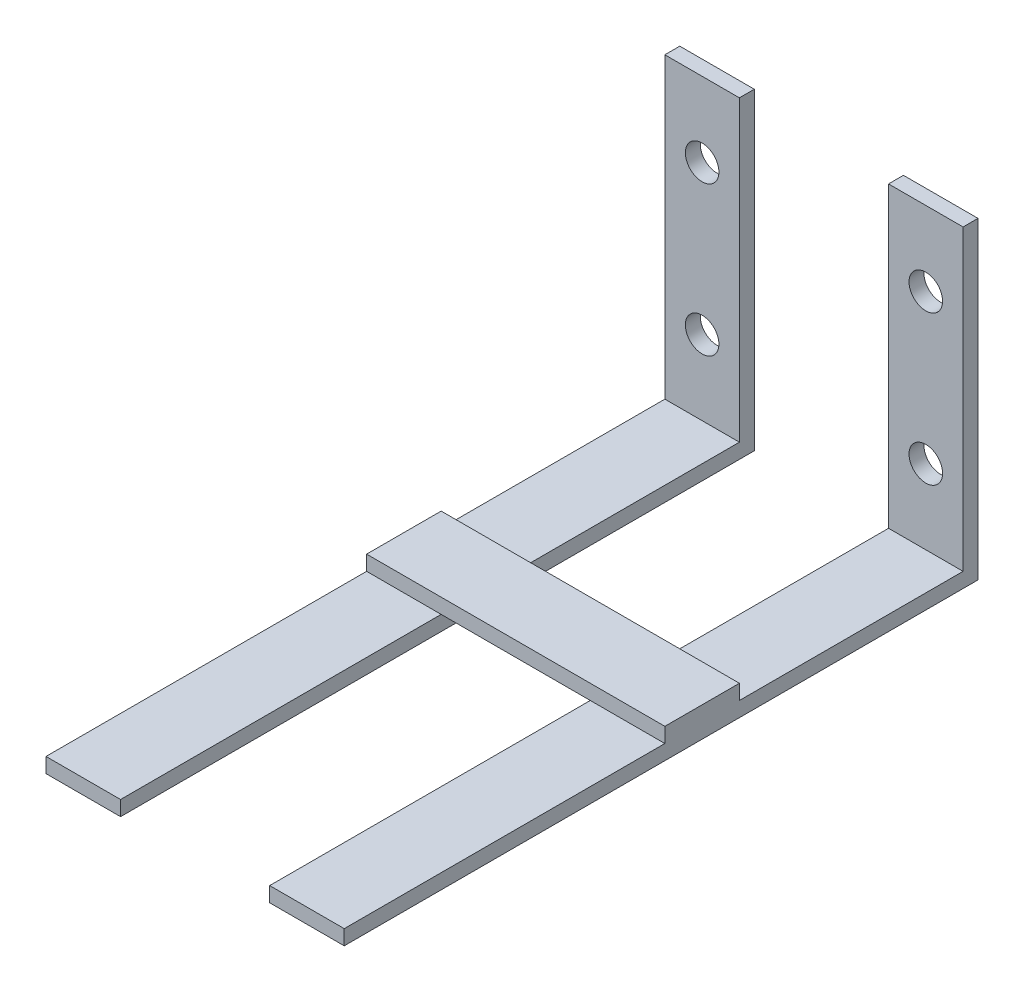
from build123d import *

# Parameters (mm, degrees)
SCHIZZO1_W                     = 10
SCHIZZO1_H                     = 85
ESTRUSIONE_ESTRUSIONE1_DEPTH   = 2
ESTRUSIONE_ESTRUSIONE1_2_DEPTH = 2
SCHIZZO2_W                     = 10
SCHIZZO2_H                     = 2
ESTRUSIONE_ESTRUSIONE2_DEPTH   = 40
SCHIZZO3_W                     = 40
SCHIZZO3_H                     = 10
ESTRUSIONE_ESTRUSIONE3_DEPTH   = 2
FORO_PER_VITE_M4_1_D           = 4.5


with BuildPart() as part:
    # Schizzo1 → Estrusione-Estrusione1 (new body)
    with BuildSketch(Plane(origin=(0, 0, 0), x_dir=(1, 0, 0), z_dir=(0, 1, 0))):
        with Locations((-15, -42.5)):
            Rectangle(SCHIZZO1_W, SCHIZZO1_H)
    extrude(amount=ESTRUSIONE_ESTRUSIONE1_DEPTH)



with BuildPart() as body_2:
    # Schizzo1 → Estrusione-Estrusione1 2 (new body)
    with BuildSketch(Plane(origin=(0, 0, 0), x_dir=(1, 0, 0), z_dir=(0, 1, 0))):
        with Locations((15, -42.5)):
            Rectangle(SCHIZZO1_W, SCHIZZO1_H)
    extrude(amount=ESTRUSIONE_ESTRUSIONE1_2_DEPTH)


with BuildPart() as part_1:
    add(part.part)

    add(body_2.part)  # Estrusione-Estrusione2 merges body 2
    # Schizzo2 → Estrusione-Estrusione2 (add)
    with BuildSketch(Plane(origin=(0, 2, 0), x_dir=(1, 0, 0), z_dir=(0, 1, 0))):
        with Locations((-15, -1)):
            Rectangle(SCHIZZO2_W, SCHIZZO2_H)
        with Locations((15, -1)):
            Rectangle(SCHIZZO2_W, SCHIZZO2_H)
    extrude(amount=ESTRUSIONE_ESTRUSIONE2_DEPTH)

    # Schizzo3 → Estrusione-Estrusione3 (add)
    with BuildSketch(Plane(origin=(0, 2, 0), x_dir=(1, 0, 0), z_dir=(0, 1, 0))):
        with Locations((0, -37)):
            Rectangle(SCHIZZO3_W, SCHIZZO3_H)
    extrude(amount=ESTRUSIONE_ESTRUSIONE3_DEPTH)

    # Foro per Vite M4-1 (through all)
    with Locations(Plane.XY.offset(2)):
        with Locations((-15, 32), (-15, 12), (15, 32), (15, 12)):
            Hole(FORO_PER_VITE_M4_1_D / 2)


solid = part_1.part
